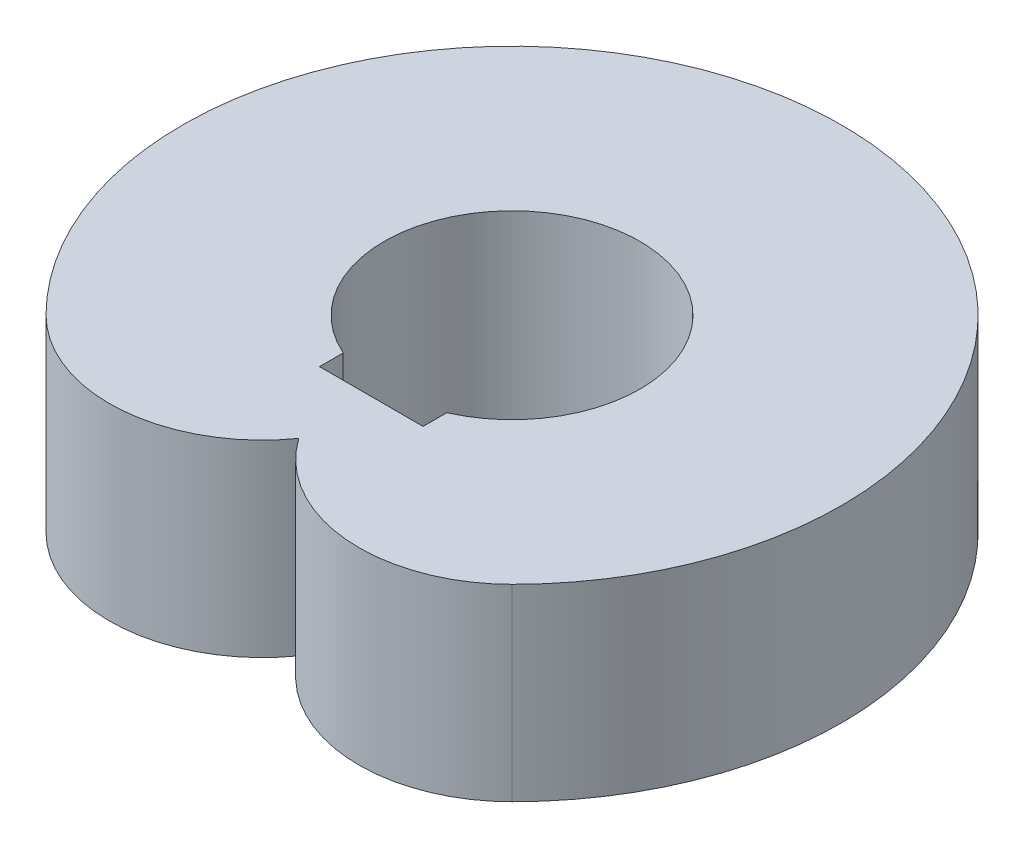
from build123d import *

# Parameters (mm, degrees)
EXTRUDE_1_DEPTH = 400


with BuildPart() as part:
    # Sketch 1 → Extrude 1 (new body)
    with BuildSketch(Plane(origin=(0, 0, 0), x_dir=(1, 0, 0), z_dir=(0, 1, 0))):
        with BuildLine():
            ThreePointArc((494.974746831, -494.974746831), (0, 700), (-494.974746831, -494.974746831))
            ThreePointArc((-494.974746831, -494.974746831), (-237.755805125, -589.007186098), (0, -453.081247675))
            ThreePointArc((0, -453.081247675), (237.755805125, -589.007186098), (494.974746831, -494.974746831))
        make_face()
        with BuildLine():
            Line((-110, -299), (110, -299))
            Line((110, -299), (110, -248.58141943))
            ThreePointArc((110, -248.58141943), (0, 271.832157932), (-110, -248.58141943))
            Line((-110, -248.58141943), (-110, -299))
        make_face(mode=Mode.SUBTRACT)
    extrude(amount=EXTRUDE_1_DEPTH)


solid = part.part
